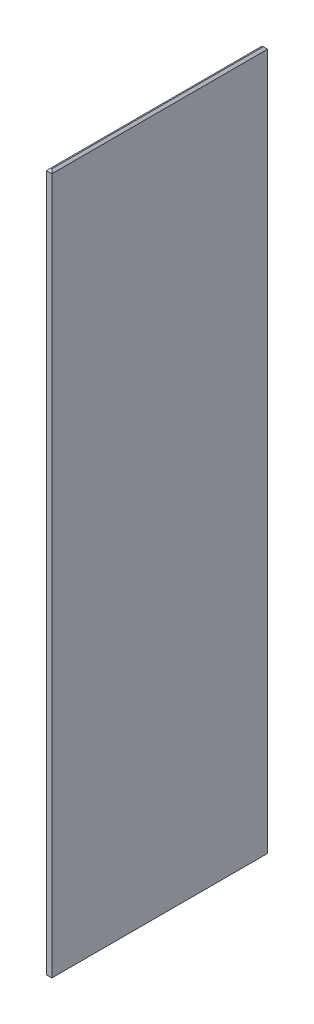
ISO-10303-21;
HEADER;
FILE_DESCRIPTION(('STEP AP214'),'2;1');
FILE_NAME('part.step','',(''),(''),'','','');
FILE_SCHEMA(('AUTOMOTIVE_DESIGN { 1 0 10303 214 1 1 1 1 }'));
ENDSEC;
DATA;
#1=APPLICATION_CONTEXT('core data for automotive mechanical design processes');
#2=APPLICATION_PROTOCOL_DEFINITION('international standard','automotive_design',2000,#1);
#3=PRODUCT_CONTEXT('',#1,'mechanical');
#4=PRODUCT('Part','Part','',(#3));
#5=PRODUCT_RELATED_PRODUCT_CATEGORY('part','',(#4));
#6=PRODUCT_DEFINITION_FORMATION('','',#4);
#7=PRODUCT_DEFINITION_CONTEXT('part definition',#1,'design');
#8=PRODUCT_DEFINITION('design','',#6,#7);
#9=PRODUCT_DEFINITION_SHAPE('','',#8);
#10=(LENGTH_UNIT() NAMED_UNIT(*) SI_UNIT(.MILLI.,.METRE.));
#11=(NAMED_UNIT(*) PLANE_ANGLE_UNIT() SI_UNIT($,.RADIAN.));
#12=(NAMED_UNIT(*) SI_UNIT($,.STERADIAN.) SOLID_ANGLE_UNIT());
#13=UNCERTAINTY_MEASURE_WITH_UNIT(LENGTH_MEASURE(1.E-05),#10,'distance_accuracy_value','');
#14=(GEOMETRIC_REPRESENTATION_CONTEXT(3) GLOBAL_UNCERTAINTY_ASSIGNED_CONTEXT((#13)) GLOBAL_UNIT_ASSIGNED_CONTEXT((#10,
#11,#12)) REPRESENTATION_CONTEXT('',''));
#15=CARTESIAN_POINT('',(0.,0.,0.));
#16=DIRECTION('',(0.,0.,1.));
#17=DIRECTION('',(1.,0.,0.));
#18=AXIS2_PLACEMENT_3D('',#15,#16,#17);
#19=CARTESIAN_POINT('',(-38.0999999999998,9739.6,1500.));
#20=DIRECTION('',(1.,0.,0.));
#21=DIRECTION('',(0.,0.,-1.));
#22=AXIS2_PLACEMENT_3D('',#19,#20,#21);
#23=PLANE('',#22);
#24=DIRECTION('',(0.,-1.,0.));
#25=VECTOR('',#24,1.);
#26=CARTESIAN_POINT('',(-38.1000000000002,9739.6,-1500.));
#27=LINE('',#26,#25);
#28=CARTESIAN_POINT('',(-38.1000000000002,9709.6,-1500.));
#29=VERTEX_POINT('',#28);
#30=CARTESIAN_POINT('',(-38.1000000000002,30.0000000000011,-1500.));
#31=VERTEX_POINT('',#30);
#32=EDGE_CURVE('E170',#29,#31,#27,.T.);
#33=ORIENTED_EDGE('',*,*,#32,.T.);
#34=DIRECTION('',(0.,0.,1.));
#35=VECTOR('',#34,1.);
#36=CARTESIAN_POINT('',(-38.0999999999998,30.0000000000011,1500.));
#37=LINE('',#36,#35);
#38=CARTESIAN_POINT('',(-38.0999999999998,30.0000000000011,1500.));
#39=VERTEX_POINT('',#38);
#40=EDGE_CURVE('E181',#31,#39,#37,.T.);
#41=ORIENTED_EDGE('',*,*,#40,.T.);
#42=DIRECTION('',(0.,-1.,0.));
#43=VECTOR('',#42,1.);
#44=CARTESIAN_POINT('',(-38.0999999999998,9739.6,1500.));
#45=LINE('',#44,#43);
#46=CARTESIAN_POINT('',(-38.0999999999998,9709.6,1500.));
#47=VERTEX_POINT('',#46);
#48=EDGE_CURVE('E136',#47,#39,#45,.T.);
#49=ORIENTED_EDGE('',*,*,#48,.F.);
#50=DIRECTION('',(0.,0.,-1.));
#51=VECTOR('',#50,1.);
#52=CARTESIAN_POINT('',(-38.1000000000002,9709.6,-1500.));
#53=LINE('',#52,#51);
#54=EDGE_CURVE('E183',#47,#29,#53,.T.);
#55=ORIENTED_EDGE('',*,*,#54,.T.);
#56=EDGE_LOOP('',(#33,#41,#49,#55));
#57=FACE_BOUND('',#56,.T.);
#58=ADVANCED_FACE('F50',(#57),#23,.F.);
#59=CARTESIAN_POINT('',(38.1000000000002,9739.6,1500.));
#60=DIRECTION('',(0.,0.,-1.));
#61=DIRECTION('',(-1.,0.,0.));
#62=AXIS2_PLACEMENT_3D('',#59,#60,#61);
#63=PLANE('',#62);
#64=ORIENTED_EDGE('',*,*,#48,.T.);
#65=DIRECTION('',(1.,0.,0.));
#66=VECTOR('',#65,1.);
#67=CARTESIAN_POINT('',(38.1000000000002,30.0000000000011,1500.));
#68=LINE('',#67,#66);
#69=CARTESIAN_POINT('',(38.1000000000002,30.0000000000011,1500.));
#70=VERTEX_POINT('',#69);
#71=EDGE_CURVE('E138',#39,#70,#68,.T.);
#72=ORIENTED_EDGE('',*,*,#71,.T.);
#73=DIRECTION('',(0.,-1.,0.));
#74=VECTOR('',#73,1.);
#75=CARTESIAN_POINT('',(38.1000000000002,9739.6,1500.));
#76=LINE('',#75,#74);
#77=CARTESIAN_POINT('',(38.1000000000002,9709.6,1500.));
#78=VERTEX_POINT('',#77);
#79=EDGE_CURVE('E117',#78,#70,#76,.T.);
#80=ORIENTED_EDGE('',*,*,#79,.F.);
#81=DIRECTION('',(-1.,0.,0.));
#82=VECTOR('',#81,1.);
#83=CARTESIAN_POINT('',(-38.0999999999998,9709.6,1500.));
#84=LINE('',#83,#82);
#85=EDGE_CURVE('E134',#78,#47,#84,.T.);
#86=ORIENTED_EDGE('',*,*,#85,.T.);
#87=EDGE_LOOP('',(#64,#72,#80,#86));
#88=FACE_BOUND('',#87,.T.);
#89=ADVANCED_FACE('F135',(#88),#63,.F.);
#90=CARTESIAN_POINT('',(38.1000000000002,9739.6,1500.));
#91=DIRECTION('',(-1.,0.,0.));
#92=DIRECTION('',(0.,0.,1.));
#93=AXIS2_PLACEMENT_3D('',#90,#91,#92);
#94=PLANE('',#93);
#95=ORIENTED_EDGE('',*,*,#79,.T.);
#96=DIRECTION('',(0.,0.,-1.));
#97=VECTOR('',#96,1.);
#98=CARTESIAN_POINT('',(38.1000000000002,30.0000000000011,1500.));
#99=LINE('',#98,#97);
#100=CARTESIAN_POINT('',(38.0999999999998,30.0000000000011,-1500.));
#101=VERTEX_POINT('',#100);
#102=EDGE_CURVE('E123',#70,#101,#99,.T.);
#103=ORIENTED_EDGE('',*,*,#102,.T.);
#104=DIRECTION('',(0.,-1.,0.));
#105=VECTOR('',#104,1.);
#106=CARTESIAN_POINT('',(38.0999999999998,9739.6,-1500.));
#107=LINE('',#106,#105);
#108=CARTESIAN_POINT('',(38.0999999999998,9709.6,-1500.));
#109=VERTEX_POINT('',#108);
#110=EDGE_CURVE('E119',#109,#101,#107,.T.);
#111=ORIENTED_EDGE('',*,*,#110,.F.);
#112=DIRECTION('',(0.,0.,1.));
#113=VECTOR('',#112,1.);
#114=CARTESIAN_POINT('',(38.1000000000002,9709.6,1500.));
#115=LINE('',#114,#113);
#116=EDGE_CURVE('E114',#109,#78,#115,.T.);
#117=ORIENTED_EDGE('',*,*,#116,.T.);
#118=EDGE_LOOP('',(#95,#103,#111,#117));
#119=FACE_BOUND('',#118,.T.);
#120=ADVANCED_FACE('F120',(#119),#94,.F.);
#121=CARTESIAN_POINT('',(38.0999999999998,9739.6,-1500.));
#122=DIRECTION('',(0.,0.,1.));
#123=DIRECTION('',(1.,0.,0.));
#124=AXIS2_PLACEMENT_3D('',#121,#122,#123);
#125=PLANE('',#124);
#126=ORIENTED_EDGE('',*,*,#110,.T.);
#127=DIRECTION('',(-1.,0.,0.));
#128=VECTOR('',#127,1.);
#129=CARTESIAN_POINT('',(38.0999999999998,30.0000000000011,-1500.));
#130=LINE('',#129,#128);
#131=EDGE_CURVE('E190',#101,#31,#130,.T.);
#132=ORIENTED_EDGE('',*,*,#131,.T.);
#133=ORIENTED_EDGE('',*,*,#32,.F.);
#134=DIRECTION('',(1.,0.,0.));
#135=VECTOR('',#134,1.);
#136=CARTESIAN_POINT('',(38.0999999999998,9709.6,-1500.));
#137=LINE('',#136,#135);
#138=EDGE_CURVE('E188',#29,#109,#137,.T.);
#139=ORIENTED_EDGE('',*,*,#138,.T.);
#140=EDGE_LOOP('',(#126,#132,#133,#139));
#141=FACE_BOUND('',#140,.T.);
#142=ADVANCED_FACE('F238',(#141),#125,.F.);
#143=CARTESIAN_POINT('',(0.,9739.6,0.));
#144=DIRECTION('',(0.,1.,0.));
#145=DIRECTION('',(0.,0.,1.));
#146=AXIS2_PLACEMENT_3D('',#143,#144,#145);
#147=PLANE('',#146);
#148=DIRECTION('',(0.,0.,-1.));
#149=VECTOR('',#148,1.);
#150=CARTESIAN_POINT('',(8.10000000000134,9739.6,-1500.));
#151=LINE('',#150,#149);
#152=CARTESIAN_POINT('',(8.10000000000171,9739.6,1470.));
#153=VERTEX_POINT('',#152);
#154=CARTESIAN_POINT('',(8.10000000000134,9739.6,-1470.));
#155=VERTEX_POINT('',#154);
#156=EDGE_CURVE('E59',#153,#155,#151,.T.);
#157=ORIENTED_EDGE('',*,*,#156,.T.);
#158=DIRECTION('',(-1.,0.,0.));
#159=VECTOR('',#158,1.);
#160=CARTESIAN_POINT('',(-38.1000000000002,9739.6,-1470.));
#161=LINE('',#160,#159);
#162=CARTESIAN_POINT('',(-8.10000000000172,9739.6,-1470.));
#163=VERTEX_POINT('',#162);
#164=EDGE_CURVE('E11',#155,#163,#161,.T.);
#165=ORIENTED_EDGE('',*,*,#164,.T.);
#166=DIRECTION('',(0.,0.,1.));
#167=VECTOR('',#166,1.);
#168=CARTESIAN_POINT('',(-8.10000000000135,9739.6,1500.));
#169=LINE('',#168,#167);
#170=CARTESIAN_POINT('',(-8.10000000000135,9739.6,1470.));
#171=VERTEX_POINT('',#170);
#172=EDGE_CURVE('E178',#163,#171,#169,.T.);
#173=ORIENTED_EDGE('',*,*,#172,.T.);
#174=DIRECTION('',(1.,0.,0.));
#175=VECTOR('',#174,1.);
#176=CARTESIAN_POINT('',(38.1000000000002,9739.6,1470.));
#177=LINE('',#176,#175);
#178=EDGE_CURVE('E66',#171,#153,#177,.T.);
#179=ORIENTED_EDGE('',*,*,#178,.T.);
#180=EDGE_LOOP('',(#157,#165,#173,#179));
#181=FACE_BOUND('',#180,.T.);
#182=ADVANCED_FACE('F242',(#181),#147,.T.);
#183=CARTESIAN_POINT('',(0.,0.,0.));
#184=DIRECTION('',(0.,1.,0.));
#185=DIRECTION('',(0.,0.,1.));
#186=AXIS2_PLACEMENT_3D('',#183,#184,#185);
#187=PLANE('',#186);
#188=DIRECTION('',(0.,0.,1.));
#189=VECTOR('',#188,1.);
#190=CARTESIAN_POINT('',(8.09999999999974,0.,0.));
#191=LINE('',#190,#189);
#192=CARTESIAN_POINT('',(8.09999999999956,0.,-1470.));
#193=VERTEX_POINT('',#192);
#194=CARTESIAN_POINT('',(8.09999999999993,0.,1470.));
#195=VERTEX_POINT('',#194);
#196=EDGE_CURVE('E199',#193,#195,#191,.T.);
#197=ORIENTED_EDGE('',*,*,#196,.T.);
#198=DIRECTION('',(-1.,0.,0.));
#199=VECTOR('',#198,1.);
#200=CARTESIAN_POINT('',(0.,0.,1470.));
#201=LINE('',#200,#199);
#202=CARTESIAN_POINT('',(-8.09999999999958,0.,1470.));
#203=VERTEX_POINT('',#202);
#204=EDGE_CURVE('E127',#195,#203,#201,.T.);
#205=ORIENTED_EDGE('',*,*,#204,.T.);
#206=DIRECTION('',(0.,0.,-1.));
#207=VECTOR('',#206,1.);
#208=CARTESIAN_POINT('',(-8.09999999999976,0.,0.));
#209=LINE('',#208,#207);
#210=CARTESIAN_POINT('',(-8.09999999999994,0.,-1470.));
#211=VERTEX_POINT('',#210);
#212=EDGE_CURVE('E204',#203,#211,#209,.T.);
#213=ORIENTED_EDGE('',*,*,#212,.T.);
#214=DIRECTION('',(1.,0.,0.));
#215=VECTOR('',#214,1.);
#216=CARTESIAN_POINT('',(0.,0.,-1470.));
#217=LINE('',#216,#215);
#218=EDGE_CURVE('E203',#211,#193,#217,.T.);
#219=ORIENTED_EDGE('',*,*,#218,.T.);
#220=EDGE_LOOP('',(#197,#205,#213,#219));
#221=FACE_BOUND('',#220,.T.);
#222=ADVANCED_FACE('F246',(#221),#187,.F.);
#223=CARTESIAN_POINT('',(38.0999999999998,30.0000000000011,-1500.));
#224=DIRECTION('',(0.,0.707106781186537,0.707106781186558));
#225=DIRECTION('',(-1.,0.,0.));
#226=AXIS2_PLACEMENT_3D('',#223,#224,#225);
#227=PLANE('',#226);
#228=DIRECTION('',(-0.57735026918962,-0.577350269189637,0.57735026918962));
#229=VECTOR('',#228,1.);
#230=CARTESIAN_POINT('',(38.0999999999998,30.0000000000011,-1500.));
#231=LINE('',#230,#229);
#232=EDGE_CURVE('E166',#193,#101,#231,.F.);
#233=ORIENTED_EDGE('',*,*,#232,.F.);
#234=ORIENTED_EDGE('',*,*,#218,.F.);
#235=DIRECTION('',(0.57735026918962,-0.577350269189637,0.57735026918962));
#236=VECTOR('',#235,1.);
#237=CARTESIAN_POINT('',(961.89999999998,-970.000000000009,-500.00000000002));
#238=LINE('',#237,#236);
#239=EDGE_CURVE('E161',#31,#211,#238,.T.);
#240=ORIENTED_EDGE('',*,*,#239,.F.);
#241=ORIENTED_EDGE('',*,*,#131,.F.);
#242=EDGE_LOOP('',(#233,#234,#240,#241));
#243=FACE_BOUND('',#242,.T.);
#244=ADVANCED_FACE('F222',(#243),#227,.F.);
#245=CARTESIAN_POINT('',(-38.0999999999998,30.0000000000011,1500.));
#246=DIRECTION('',(0.707106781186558,0.707106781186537,0.));
#247=DIRECTION('',(0.,0.,1.));
#248=AXIS2_PLACEMENT_3D('',#245,#246,#247);
#249=PLANE('',#248);
#250=ORIENTED_EDGE('',*,*,#239,.T.);
#251=ORIENTED_EDGE('',*,*,#212,.F.);
#252=DIRECTION('',(-0.57735026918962,0.577350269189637,0.57735026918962));
#253=VECTOR('',#252,1.);
#254=CARTESIAN_POINT('',(-38.0999999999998,30.0000000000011,1500.));
#255=LINE('',#254,#253);
#256=EDGE_CURVE('E155',#39,#203,#255,.F.);
#257=ORIENTED_EDGE('',*,*,#256,.F.);
#258=ORIENTED_EDGE('',*,*,#40,.F.);
#259=EDGE_LOOP('',(#250,#251,#257,#258));
#260=FACE_BOUND('',#259,.T.);
#261=ADVANCED_FACE('F230',(#260),#249,.F.);
#262=CARTESIAN_POINT('',(38.1000000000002,30.0000000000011,1500.));
#263=DIRECTION('',(-0.707106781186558,0.707106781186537,0.));
#264=DIRECTION('',(0.,0.,-1.));
#265=AXIS2_PLACEMENT_3D('',#262,#263,#264);
#266=PLANE('',#265);
#267=ORIENTED_EDGE('',*,*,#232,.T.);
#268=ORIENTED_EDGE('',*,*,#102,.F.);
#269=DIRECTION('',(-0.57735026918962,-0.577350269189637,-0.57735026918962));
#270=VECTOR('',#269,1.);
#271=CARTESIAN_POINT('',(38.1000000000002,30.0000000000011,1500.));
#272=LINE('',#271,#270);
#273=EDGE_CURVE('E146',#195,#70,#272,.F.);
#274=ORIENTED_EDGE('',*,*,#273,.F.);
#275=ORIENTED_EDGE('',*,*,#196,.F.);
#276=EDGE_LOOP('',(#267,#268,#274,#275));
#277=FACE_BOUND('',#276,.T.);
#278=ADVANCED_FACE('F240',(#277),#266,.F.);
#279=CARTESIAN_POINT('',(38.1000000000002,30.0000000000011,1500.));
#280=DIRECTION('',(0.,0.707106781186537,-0.707106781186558));
#281=DIRECTION('',(1.,0.,0.));
#282=AXIS2_PLACEMENT_3D('',#279,#280,#281);
#283=PLANE('',#282);
#284=ORIENTED_EDGE('',*,*,#256,.T.);
#285=ORIENTED_EDGE('',*,*,#204,.F.);
#286=ORIENTED_EDGE('',*,*,#273,.T.);
#287=ORIENTED_EDGE('',*,*,#71,.F.);
#288=EDGE_LOOP('',(#284,#285,#286,#287));
#289=FACE_BOUND('',#288,.T.);
#290=ADVANCED_FACE('F235',(#289),#283,.F.);
#291=CARTESIAN_POINT('',(0.,9739.6,1470.));
#292=DIRECTION('',(0.,0.707106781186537,0.707106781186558));
#293=DIRECTION('',(-1.,0.,0.));
#294=AXIS2_PLACEMENT_3D('',#291,#292,#293);
#295=PLANE('',#294);
#296=DIRECTION('',(0.57735026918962,0.577350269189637,-0.57735026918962));
#297=VECTOR('',#296,1.);
#298=CARTESIAN_POINT('',(481.899999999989,10229.6,980.000000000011));
#299=LINE('',#298,#297);
#300=EDGE_CURVE('E141',#47,#171,#299,.T.);
#301=ORIENTED_EDGE('',*,*,#300,.F.);
#302=ORIENTED_EDGE('',*,*,#85,.F.);
#303=DIRECTION('',(-0.57735026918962,0.577350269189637,-0.57735026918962));
#304=VECTOR('',#303,1.);
#305=CARTESIAN_POINT('',(5.40000000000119,9742.3,1467.3));
#306=LINE('',#305,#304);
#307=EDGE_CURVE('E55',#153,#78,#306,.F.);
#308=ORIENTED_EDGE('',*,*,#307,.F.);
#309=ORIENTED_EDGE('',*,*,#178,.F.);
#310=EDGE_LOOP('',(#301,#302,#308,#309));
#311=FACE_BOUND('',#310,.T.);
#312=ADVANCED_FACE('F49',(#311),#295,.T.);
#313=CARTESIAN_POINT('',(8.10000000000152,9739.6,0.));
#314=DIRECTION('',(0.707106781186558,0.707106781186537,0.));
#315=DIRECTION('',(0.,0.,1.));
#316=AXIS2_PLACEMENT_3D('',#313,#314,#315);
#317=PLANE('',#316);
#318=ORIENTED_EDGE('',*,*,#307,.T.);
#319=ORIENTED_EDGE('',*,*,#116,.F.);
#320=DIRECTION('',(-0.57735026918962,0.577350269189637,0.57735026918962));
#321=VECTOR('',#320,1.);
#322=CARTESIAN_POINT('',(-481.899999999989,10229.6,-980.000000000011));
#323=LINE('',#322,#321);
#324=EDGE_CURVE('E151',#155,#109,#323,.F.);
#325=ORIENTED_EDGE('',*,*,#324,.F.);
#326=ORIENTED_EDGE('',*,*,#156,.F.);
#327=EDGE_LOOP('',(#318,#319,#325,#326));
#328=FACE_BOUND('',#327,.T.);
#329=ADVANCED_FACE('F150',(#328),#317,.T.);
#330=CARTESIAN_POINT('',(-8.10000000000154,9739.6,0.));
#331=DIRECTION('',(-0.707106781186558,0.707106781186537,0.));
#332=DIRECTION('',(0.,0.,-1.));
#333=AXIS2_PLACEMENT_3D('',#330,#331,#332);
#334=PLANE('',#333);
#335=ORIENTED_EDGE('',*,*,#300,.T.);
#336=ORIENTED_EDGE('',*,*,#172,.F.);
#337=DIRECTION('',(-0.57735026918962,-0.577350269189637,-0.57735026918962));
#338=VECTOR('',#337,1.);
#339=CARTESIAN_POINT('',(481.899999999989,10229.6,-980.000000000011));
#340=LINE('',#339,#338);
#341=EDGE_CURVE('E156',#29,#163,#340,.F.);
#342=ORIENTED_EDGE('',*,*,#341,.F.);
#343=ORIENTED_EDGE('',*,*,#54,.F.);
#344=EDGE_LOOP('',(#335,#336,#342,#343));
#345=FACE_BOUND('',#344,.T.);
#346=ADVANCED_FACE('F243',(#345),#334,.T.);
#347=CARTESIAN_POINT('',(0.,9739.6,-1470.));
#348=DIRECTION('',(0.,0.707106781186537,-0.707106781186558));
#349=DIRECTION('',(1.,0.,0.));
#350=AXIS2_PLACEMENT_3D('',#347,#348,#349);
#351=PLANE('',#350);
#352=ORIENTED_EDGE('',*,*,#324,.T.);
#353=ORIENTED_EDGE('',*,*,#138,.F.);
#354=ORIENTED_EDGE('',*,*,#341,.T.);
#355=ORIENTED_EDGE('',*,*,#164,.F.);
#356=EDGE_LOOP('',(#352,#353,#354,#355));
#357=FACE_BOUND('',#356,.T.);
#358=ADVANCED_FACE('F241',(#357),#351,.T.);
#359=CLOSED_SHELL('',(#58,#89,#120,#142,#182,#222,#244,#261,#278,#290,#312,#329,#346,#358));
#360=MANIFOLD_SOLID_BREP('B2',#359);
#361=ADVANCED_BREP_SHAPE_REPRESENTATION('',(#18,#360),#14);
#362=SHAPE_DEFINITION_REPRESENTATION(#9,#361);
ENDSEC;
END-ISO-10303-21;
